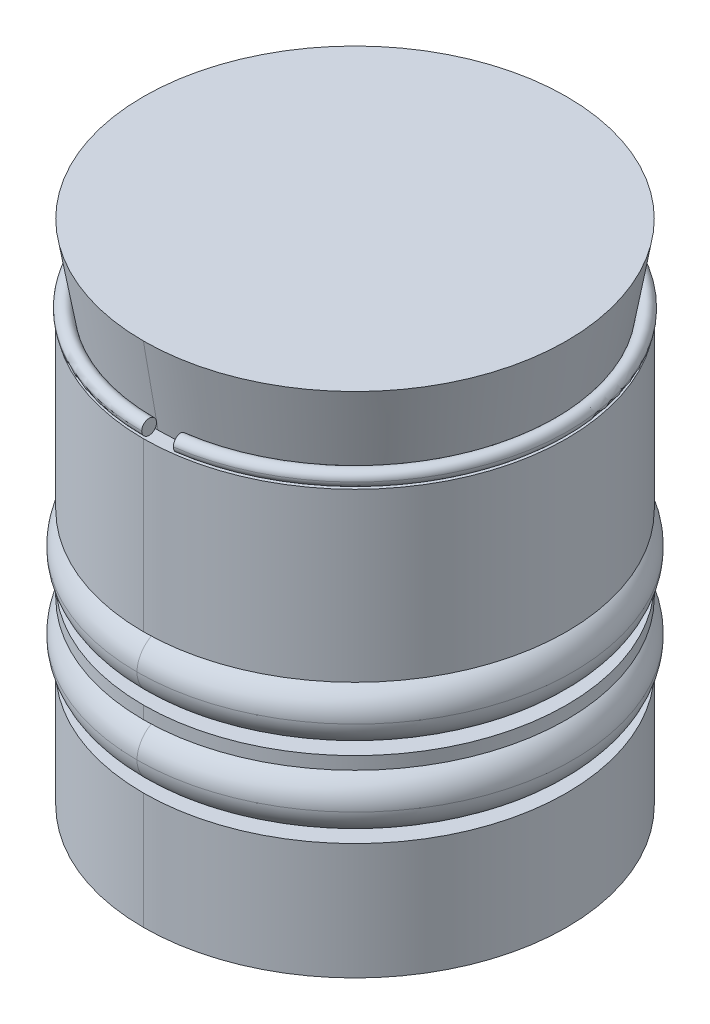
ISO-10303-21;
HEADER;
FILE_DESCRIPTION(('STEP AP214'),'2;1');
FILE_NAME('part.step','',(''),(''),'','','');
FILE_SCHEMA(('AUTOMOTIVE_DESIGN { 1 0 10303 214 1 1 1 1 }'));
ENDSEC;
DATA;
#1=APPLICATION_CONTEXT('core data for automotive mechanical design processes');
#2=APPLICATION_PROTOCOL_DEFINITION('international standard','automotive_design',2000,#1);
#3=PRODUCT_CONTEXT('',#1,'mechanical');
#4=PRODUCT('Part','Part','',(#3));
#5=PRODUCT_RELATED_PRODUCT_CATEGORY('part','',(#4));
#6=PRODUCT_DEFINITION_FORMATION('','',#4);
#7=PRODUCT_DEFINITION_CONTEXT('part definition',#1,'design');
#8=PRODUCT_DEFINITION('design','',#6,#7);
#9=PRODUCT_DEFINITION_SHAPE('','',#8);
#10=(LENGTH_UNIT() NAMED_UNIT(*) SI_UNIT(.MILLI.,.METRE.));
#11=(NAMED_UNIT(*) PLANE_ANGLE_UNIT() SI_UNIT($,.RADIAN.));
#12=(NAMED_UNIT(*) SI_UNIT($,.STERADIAN.) SOLID_ANGLE_UNIT());
#13=UNCERTAINTY_MEASURE_WITH_UNIT(LENGTH_MEASURE(1.E-05),#10,'distance_accuracy_value','');
#14=(GEOMETRIC_REPRESENTATION_CONTEXT(3) GLOBAL_UNCERTAINTY_ASSIGNED_CONTEXT((#13)) GLOBAL_UNIT_ASSIGNED_CONTEXT((#10,
#11,#12)) REPRESENTATION_CONTEXT('',''));
#15=CARTESIAN_POINT('',(0.,0.,0.));
#16=DIRECTION('',(0.,0.,1.));
#17=DIRECTION('',(1.,0.,0.));
#18=AXIS2_PLACEMENT_3D('',#15,#16,#17);
#19=CARTESIAN_POINT('',(0.,12.,0.));
#20=DIRECTION('',(0.,-1.,0.));
#21=DIRECTION('',(0.,0.,-1.));
#22=AXIS2_PLACEMENT_3D('',#19,#20,#21);
#23=PLANE('',#22);
#24=CARTESIAN_POINT('',(0.,12.,0.));
#25=DIRECTION('',(0.,1.,0.));
#26=DIRECTION('',(0.,0.,1.));
#27=AXIS2_PLACEMENT_3D('',#24,#25,#26);
#28=CIRCLE('',#27,5.);
#29=CARTESIAN_POINT('',(0.,12.,5.));
#30=VERTEX_POINT('',#29);
#31=CARTESIAN_POINT('',(0.,12.,-5.));
#32=VERTEX_POINT('',#31);
#33=EDGE_CURVE('P0_E194',#30,#32,#28,.T.);
#34=ORIENTED_EDGE('',*,*,#33,.T.);
#35=CARTESIAN_POINT('',(0.,12.,0.));
#36=DIRECTION('',(0.,1.,0.));
#37=DIRECTION('',(0.,0.,1.));
#38=AXIS2_PLACEMENT_3D('',#35,#36,#37);
#39=CIRCLE('',#38,5.);
#40=EDGE_CURVE('P0_E11',#32,#30,#39,.T.);
#41=ORIENTED_EDGE('',*,*,#40,.T.);
#42=EDGE_LOOP('',(#34,#41));
#43=FACE_BOUND('',#42,.T.);
#44=ADVANCED_FACE('P0_F16',(#43),#23,.F.);
#45=CARTESIAN_POINT('',(0.,10.,0.));
#46=DIRECTION('',(0.,1.,0.));
#47=DIRECTION('',(0.,0.,1.));
#48=AXIS2_PLACEMENT_3D('',#45,#46,#47);
#49=CONICAL_SURFACE('',#48,4.65371595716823,0.171442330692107);
#50=DIRECTION('',(0.,0.985339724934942,-0.17060371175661));
#51=VECTOR('',#50,1.);
#52=CARTESIAN_POINT('',(0.,10.,-4.65371595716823));
#53=LINE('',#52,#51);
#54=CARTESIAN_POINT('',(0.,10.,-4.65371595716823));
#55=VERTEX_POINT('',#54);
#56=EDGE_CURVE('P0_E190',#55,#32,#53,.T.);
#57=ORIENTED_EDGE('',*,*,#56,.F.);
#58=CARTESIAN_POINT('',(0.,10.,0.));
#59=DIRECTION('',(0.,1.,0.));
#60=DIRECTION('',(0.,0.,1.));
#61=AXIS2_PLACEMENT_3D('',#58,#59,#60);
#62=CIRCLE('',#61,4.65371595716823);
#63=CARTESIAN_POINT('',(0.,10.,4.65371595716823));
#64=VERTEX_POINT('',#63);
#65=EDGE_CURVE('P0_E27',#55,#64,#62,.T.);
#66=ORIENTED_EDGE('',*,*,#65,.T.);
#67=DIRECTION('',(0.,0.985339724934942,0.17060371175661));
#68=VECTOR('',#67,1.);
#69=CARTESIAN_POINT('',(0.,10.,4.65371595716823));
#70=LINE('',#69,#68);
#71=EDGE_CURVE('P0_E156',#64,#30,#70,.T.);
#72=ORIENTED_EDGE('',*,*,#71,.T.);
#73=ORIENTED_EDGE('',*,*,#40,.F.);
#74=EDGE_LOOP('',(#57,#66,#72,#73));
#75=FACE_BOUND('',#74,.T.);
#76=ADVANCED_FACE('P0_F352',(#75),#49,.T.);
#77=CARTESIAN_POINT('',(0.,10.,-5.));
#78=DIRECTION('',(0.,-1.,0.));
#79=DIRECTION('',(0.,0.,-1.));
#80=AXIS2_PLACEMENT_3D('',#77,#78,#79);
#81=PLANE('',#80);
#82=CARTESIAN_POINT('',(0.,10.,0.));
#83=DIRECTION('',(0.,1.,0.));
#84=DIRECTION('',(0.,0.,1.));
#85=AXIS2_PLACEMENT_3D('',#82,#83,#84);
#86=CIRCLE('',#85,4.65371595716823);
#87=EDGE_CURVE('P0_E188',#64,#55,#86,.T.);
#88=ORIENTED_EDGE('',*,*,#87,.F.);
#89=ORIENTED_EDGE('',*,*,#65,.F.);
#90=EDGE_LOOP('',(#88,#89));
#91=FACE_BOUND('',#90,.T.);
#92=CARTESIAN_POINT('',(0.,10.,0.));
#93=DIRECTION('',(0.,1.,0.));
#94=DIRECTION('',(0.,0.,1.));
#95=AXIS2_PLACEMENT_3D('',#92,#93,#94);
#96=CIRCLE('',#95,5.);
#97=CARTESIAN_POINT('',(0.,10.,5.));
#98=VERTEX_POINT('',#97);
#99=CARTESIAN_POINT('',(0.,10.,-5.));
#100=VERTEX_POINT('',#99);
#101=EDGE_CURVE('P0_E141',#98,#100,#96,.T.);
#102=ORIENTED_EDGE('',*,*,#101,.T.);
#103=CARTESIAN_POINT('',(0.,10.,0.));
#104=DIRECTION('',(0.,1.,0.));
#105=DIRECTION('',(0.,0.,1.));
#106=AXIS2_PLACEMENT_3D('',#103,#104,#105);
#107=CIRCLE('',#106,5.);
#108=EDGE_CURVE('P0_E129',#100,#98,#107,.T.);
#109=ORIENTED_EDGE('',*,*,#108,.T.);
#110=EDGE_LOOP('',(#102,#109));
#111=FACE_BOUND('',#110,.T.);
#112=ADVANCED_FACE('P0_F142',(#91,#111),#81,.F.);
#113=CARTESIAN_POINT('',(0.,12.,0.));
#114=DIRECTION('',(0.,1.,0.));
#115=DIRECTION('',(0.,0.,1.));
#116=AXIS2_PLACEMENT_3D('',#113,#114,#115);
#117=CYLINDRICAL_SURFACE('',#116,5.);
#118=DIRECTION('',(0.,1.,0.));
#119=VECTOR('',#118,1.);
#120=CARTESIAN_POINT('',(0.,12.,-5.));
#121=LINE('',#120,#119);
#122=CARTESIAN_POINT('',(0.,6.05,-5.));
#123=VERTEX_POINT('',#122);
#124=EDGE_CURVE('P0_E133',#123,#100,#121,.T.);
#125=ORIENTED_EDGE('',*,*,#124,.F.);
#126=CARTESIAN_POINT('',(0.,6.05,0.));
#127=DIRECTION('',(0.,1.,0.));
#128=DIRECTION('',(0.,0.,1.));
#129=AXIS2_PLACEMENT_3D('',#126,#127,#128);
#130=CIRCLE('',#129,5.);
#131=CARTESIAN_POINT('',(0.,6.05,5.));
#132=VERTEX_POINT('',#131);
#133=EDGE_CURVE('P0_E20',#123,#132,#130,.T.);
#134=ORIENTED_EDGE('',*,*,#133,.T.);
#135=DIRECTION('',(0.,1.,0.));
#136=VECTOR('',#135,1.);
#137=CARTESIAN_POINT('',(0.,12.,5.));
#138=LINE('',#137,#136);
#139=EDGE_CURVE('P0_E136',#132,#98,#138,.T.);
#140=ORIENTED_EDGE('',*,*,#139,.T.);
#141=ORIENTED_EDGE('',*,*,#108,.F.);
#142=EDGE_LOOP('',(#125,#134,#140,#141));
#143=FACE_BOUND('',#142,.T.);
#144=ADVANCED_FACE('P0_F131',(#143),#117,.T.);
#145=CARTESIAN_POINT('',(0.,6.05,-4.5));
#146=DIRECTION('',(0.,1.,0.));
#147=DIRECTION('',(0.,0.,-1.));
#148=AXIS2_PLACEMENT_3D('',#145,#146,#147);
#149=PLANE('',#148);
#150=CARTESIAN_POINT('',(0.,6.05,0.));
#151=DIRECTION('',(0.,1.,0.));
#152=DIRECTION('',(0.,0.,1.));
#153=AXIS2_PLACEMENT_3D('',#150,#151,#152);
#154=CIRCLE('',#153,4.5);
#155=CARTESIAN_POINT('',(0.,6.05,4.5));
#156=VERTEX_POINT('',#155);
#157=CARTESIAN_POINT('',(0.,6.05,-4.5));
#158=VERTEX_POINT('',#157);
#159=EDGE_CURVE('P0_E171',#156,#158,#154,.T.);
#160=ORIENTED_EDGE('',*,*,#159,.T.);
#161=CARTESIAN_POINT('',(0.,6.05,0.));
#162=DIRECTION('',(0.,1.,0.));
#163=DIRECTION('',(0.,0.,1.));
#164=AXIS2_PLACEMENT_3D('',#161,#162,#163);
#165=CIRCLE('',#164,4.5);
#166=EDGE_CURVE('P0_E184',#158,#156,#165,.T.);
#167=ORIENTED_EDGE('',*,*,#166,.T.);
#168=EDGE_LOOP('',(#160,#167));
#169=FACE_BOUND('',#168,.T.);
#170=CARTESIAN_POINT('',(0.,6.05,0.));
#171=DIRECTION('',(0.,1.,0.));
#172=DIRECTION('',(0.,0.,1.));
#173=AXIS2_PLACEMENT_3D('',#170,#171,#172);
#174=CIRCLE('',#173,5.);
#175=EDGE_CURVE('P0_E148',#132,#123,#174,.T.);
#176=ORIENTED_EDGE('',*,*,#175,.F.);
#177=ORIENTED_EDGE('',*,*,#133,.F.);
#178=EDGE_LOOP('',(#176,#177));
#179=FACE_BOUND('',#178,.T.);
#180=ADVANCED_FACE('P0_F311',(#169,#179),#149,.F.);
#181=CARTESIAN_POINT('',(0.,5.3,0.));
#182=DIRECTION('',(0.,1.,0.));
#183=DIRECTION('',(0.,0.,1.));
#184=AXIS2_PLACEMENT_3D('',#181,#182,#183);
#185=TOROIDAL_SURFACE('',#184,4.5,0.75);
#186=CARTESIAN_POINT('',(0.,5.3,0.));
#187=DIRECTION('',(0.,1.,0.));
#188=DIRECTION('',(0.,0.,1.));
#189=AXIS2_PLACEMENT_3D('',#186,#187,#188);
#190=CIRCLE('',#189,3.75);
#191=CARTESIAN_POINT('',(0.,5.3,3.75));
#192=VERTEX_POINT('',#191);
#193=CARTESIAN_POINT('',(0.,5.3,-3.75));
#194=VERTEX_POINT('',#193);
#195=EDGE_CURVE('P0_E172',#192,#194,#190,.T.);
#196=ORIENTED_EDGE('',*,*,#195,.F.);
#197=CARTESIAN_POINT('',(0.,5.3,4.5));
#198=DIRECTION('',(-1.,0.,0.));
#199=DIRECTION('',(0.,0.,1.));
#200=AXIS2_PLACEMENT_3D('',#197,#198,#199);
#201=CIRCLE('',#200,0.75);
#202=CARTESIAN_POINT('',(0.,4.55,4.5));
#203=VERTEX_POINT('',#202);
#204=EDGE_CURVE('P0_E261',#192,#203,#201,.T.);
#205=ORIENTED_EDGE('',*,*,#204,.T.);
#206=CARTESIAN_POINT('',(0.,4.55,0.));
#207=DIRECTION('',(0.,1.,0.));
#208=DIRECTION('',(0.,0.,1.));
#209=AXIS2_PLACEMENT_3D('',#206,#207,#208);
#210=CIRCLE('',#209,4.5);
#211=CARTESIAN_POINT('',(0.,4.55,-4.5));
#212=VERTEX_POINT('',#211);
#213=EDGE_CURVE('P0_E175',#203,#212,#210,.T.);
#214=ORIENTED_EDGE('',*,*,#213,.T.);
#215=CARTESIAN_POINT('',(0.,5.3,-4.5));
#216=DIRECTION('',(1.,0.,0.));
#217=DIRECTION('',(0.,0.,-1.));
#218=AXIS2_PLACEMENT_3D('',#215,#216,#217);
#219=CIRCLE('',#218,0.75);
#220=EDGE_CURVE('P0_E160',#194,#212,#219,.T.);
#221=ORIENTED_EDGE('',*,*,#220,.F.);
#222=EDGE_LOOP('',(#196,#205,#214,#221));
#223=FACE_BOUND('',#222,.T.);
#224=ADVANCED_FACE('P0_F579',(#223),#185,.F.);
#225=CARTESIAN_POINT('',(0.,4.55,-4.5));
#226=DIRECTION('',(0.,-1.,0.));
#227=DIRECTION('',(0.,0.,-1.));
#228=AXIS2_PLACEMENT_3D('',#225,#226,#227);
#229=PLANE('',#228);
#230=ORIENTED_EDGE('',*,*,#213,.F.);
#231=CARTESIAN_POINT('',(0.,4.55,0.));
#232=DIRECTION('',(0.,1.,0.));
#233=DIRECTION('',(0.,0.,1.));
#234=AXIS2_PLACEMENT_3D('',#231,#232,#233);
#235=CIRCLE('',#234,4.5);
#236=EDGE_CURVE('P0_E257',#212,#203,#235,.T.);
#237=ORIENTED_EDGE('',*,*,#236,.F.);
#238=EDGE_LOOP('',(#230,#237));
#239=FACE_BOUND('',#238,.T.);
#240=CARTESIAN_POINT('',(0.,4.55,0.));
#241=DIRECTION('',(0.,1.,0.));
#242=DIRECTION('',(0.,0.,1.));
#243=AXIS2_PLACEMENT_3D('',#240,#241,#242);
#244=CIRCLE('',#243,5.);
#245=CARTESIAN_POINT('',(0.,4.55,5.));
#246=VERTEX_POINT('',#245);
#247=CARTESIAN_POINT('',(0.,4.55,-5.));
#248=VERTEX_POINT('',#247);
#249=EDGE_CURVE('P0_E195',#246,#248,#244,.T.);
#250=ORIENTED_EDGE('',*,*,#249,.T.);
#251=CARTESIAN_POINT('',(0.,4.55,0.));
#252=DIRECTION('',(0.,1.,0.));
#253=DIRECTION('',(0.,0.,1.));
#254=AXIS2_PLACEMENT_3D('',#251,#252,#253);
#255=CIRCLE('',#254,5.);
#256=EDGE_CURVE('P0_E173',#248,#246,#255,.T.);
#257=ORIENTED_EDGE('',*,*,#256,.T.);
#258=EDGE_LOOP('',(#250,#257));
#259=FACE_BOUND('',#258,.T.);
#260=ADVANCED_FACE('P0_F391',(#239,#259),#229,.F.);
#261=CARTESIAN_POINT('',(0.,12.,0.));
#262=DIRECTION('',(0.,1.,0.));
#263=DIRECTION('',(0.,0.,1.));
#264=AXIS2_PLACEMENT_3D('',#261,#262,#263);
#265=CYLINDRICAL_SURFACE('',#264,5.);
#266=DIRECTION('',(0.,1.,0.));
#267=VECTOR('',#266,1.);
#268=CARTESIAN_POINT('',(0.,12.,-5.));
#269=LINE('',#268,#267);
#270=CARTESIAN_POINT('',(0.,4.25,-5.));
#271=VERTEX_POINT('',#270);
#272=EDGE_CURVE('P0_E200',#271,#248,#269,.T.);
#273=ORIENTED_EDGE('',*,*,#272,.F.);
#274=CARTESIAN_POINT('',(0.,4.25,0.));
#275=DIRECTION('',(0.,1.,0.));
#276=DIRECTION('',(0.,0.,1.));
#277=AXIS2_PLACEMENT_3D('',#274,#275,#276);
#278=CIRCLE('',#277,5.);
#279=CARTESIAN_POINT('',(0.,4.25,5.));
#280=VERTEX_POINT('',#279);
#281=EDGE_CURVE('P0_E176',#271,#280,#278,.T.);
#282=ORIENTED_EDGE('',*,*,#281,.T.);
#283=DIRECTION('',(0.,1.,0.));
#284=VECTOR('',#283,1.);
#285=CARTESIAN_POINT('',(0.,12.,5.));
#286=LINE('',#285,#284);
#287=EDGE_CURVE('P0_E199',#280,#246,#286,.T.);
#288=ORIENTED_EDGE('',*,*,#287,.T.);
#289=ORIENTED_EDGE('',*,*,#256,.F.);
#290=EDGE_LOOP('',(#273,#282,#288,#289));
#291=FACE_BOUND('',#290,.T.);
#292=ADVANCED_FACE('P0_F560',(#291),#265,.T.);
#293=CARTESIAN_POINT('',(0.,4.25,-4.5));
#294=DIRECTION('',(0.,1.,0.));
#295=DIRECTION('',(0.,0.,-1.));
#296=AXIS2_PLACEMENT_3D('',#293,#294,#295);
#297=PLANE('',#296);
#298=CARTESIAN_POINT('',(0.,4.25,0.));
#299=DIRECTION('',(0.,1.,0.));
#300=DIRECTION('',(0.,0.,1.));
#301=AXIS2_PLACEMENT_3D('',#298,#299,#300);
#302=CIRCLE('',#301,4.5);
#303=CARTESIAN_POINT('',(0.,4.25,4.5));
#304=VERTEX_POINT('',#303);
#305=CARTESIAN_POINT('',(0.,4.25,-4.5));
#306=VERTEX_POINT('',#305);
#307=EDGE_CURVE('P0_E182',#304,#306,#302,.T.);
#308=ORIENTED_EDGE('',*,*,#307,.T.);
#309=CARTESIAN_POINT('',(0.,4.25,0.));
#310=DIRECTION('',(0.,1.,0.));
#311=DIRECTION('',(0.,0.,1.));
#312=AXIS2_PLACEMENT_3D('',#309,#310,#311);
#313=CIRCLE('',#312,4.5);
#314=EDGE_CURVE('P0_E181',#306,#304,#313,.T.);
#315=ORIENTED_EDGE('',*,*,#314,.T.);
#316=EDGE_LOOP('',(#308,#315));
#317=FACE_BOUND('',#316,.T.);
#318=CARTESIAN_POINT('',(0.,4.25,0.));
#319=DIRECTION('',(0.,1.,0.));
#320=DIRECTION('',(0.,0.,1.));
#321=AXIS2_PLACEMENT_3D('',#318,#319,#320);
#322=CIRCLE('',#321,5.);
#323=EDGE_CURVE('P0_E231',#280,#271,#322,.T.);
#324=ORIENTED_EDGE('',*,*,#323,.F.);
#325=ORIENTED_EDGE('',*,*,#281,.F.);
#326=EDGE_LOOP('',(#324,#325));
#327=FACE_BOUND('',#326,.T.);
#328=ADVANCED_FACE('P0_F278',(#317,#327),#297,.F.);
#329=CARTESIAN_POINT('',(0.,3.5,0.));
#330=DIRECTION('',(0.,1.,0.));
#331=DIRECTION('',(0.,0.,1.));
#332=AXIS2_PLACEMENT_3D('',#329,#330,#331);
#333=TOROIDAL_SURFACE('',#332,4.5,0.75);
#334=CARTESIAN_POINT('',(0.,3.5,0.));
#335=DIRECTION('',(0.,1.,0.));
#336=DIRECTION('',(0.,0.,1.));
#337=AXIS2_PLACEMENT_3D('',#334,#335,#336);
#338=CIRCLE('',#337,3.75);
#339=CARTESIAN_POINT('',(0.,3.5,3.75));
#340=VERTEX_POINT('',#339);
#341=CARTESIAN_POINT('',(0.,3.5,-3.75));
#342=VERTEX_POINT('',#341);
#343=EDGE_CURVE('P0_E244',#340,#342,#338,.T.);
#344=ORIENTED_EDGE('',*,*,#343,.F.);
#345=CARTESIAN_POINT('',(0.,3.5,4.5));
#346=DIRECTION('',(-1.,0.,0.));
#347=DIRECTION('',(0.,0.,1.));
#348=AXIS2_PLACEMENT_3D('',#345,#346,#347);
#349=CIRCLE('',#348,0.75);
#350=CARTESIAN_POINT('',(0.,2.75,4.5));
#351=VERTEX_POINT('',#350);
#352=EDGE_CURVE('P0_E162',#340,#351,#349,.T.);
#353=ORIENTED_EDGE('',*,*,#352,.T.);
#354=CARTESIAN_POINT('',(0.,2.75,0.));
#355=DIRECTION('',(0.,1.,0.));
#356=DIRECTION('',(0.,0.,1.));
#357=AXIS2_PLACEMENT_3D('',#354,#355,#356);
#358=CIRCLE('',#357,4.5);
#359=CARTESIAN_POINT('',(0.,2.75,-4.5));
#360=VERTEX_POINT('',#359);
#361=EDGE_CURVE('P0_E213',#351,#360,#358,.T.);
#362=ORIENTED_EDGE('',*,*,#361,.T.);
#363=CARTESIAN_POINT('',(0.,3.5,-4.5));
#364=DIRECTION('',(1.,0.,0.));
#365=DIRECTION('',(0.,0.,-1.));
#366=AXIS2_PLACEMENT_3D('',#363,#364,#365);
#367=CIRCLE('',#366,0.75);
#368=EDGE_CURVE('P0_E220',#342,#360,#367,.T.);
#369=ORIENTED_EDGE('',*,*,#368,.F.);
#370=EDGE_LOOP('',(#344,#353,#362,#369));
#371=FACE_BOUND('',#370,.T.);
#372=ADVANCED_FACE('P0_F370',(#371),#333,.F.);
#373=CARTESIAN_POINT('',(0.,2.75,-4.5));
#374=DIRECTION('',(0.,-1.,0.));
#375=DIRECTION('',(0.,0.,-1.));
#376=AXIS2_PLACEMENT_3D('',#373,#374,#375);
#377=PLANE('',#376);
#378=ORIENTED_EDGE('',*,*,#361,.F.);
#379=CARTESIAN_POINT('',(0.,2.75,0.));
#380=DIRECTION('',(0.,1.,0.));
#381=DIRECTION('',(0.,0.,1.));
#382=AXIS2_PLACEMENT_3D('',#379,#380,#381);
#383=CIRCLE('',#382,4.5);
#384=EDGE_CURVE('P0_E166',#360,#351,#383,.T.);
#385=ORIENTED_EDGE('',*,*,#384,.F.);
#386=EDGE_LOOP('',(#378,#385));
#387=FACE_BOUND('',#386,.T.);
#388=CARTESIAN_POINT('',(0.,2.75,0.));
#389=DIRECTION('',(0.,1.,0.));
#390=DIRECTION('',(0.,0.,1.));
#391=AXIS2_PLACEMENT_3D('',#388,#389,#390);
#392=CIRCLE('',#391,5.);
#393=CARTESIAN_POINT('',(0.,2.75,5.));
#394=VERTEX_POINT('',#393);
#395=CARTESIAN_POINT('',(0.,2.75,-5.));
#396=VERTEX_POINT('',#395);
#397=EDGE_CURVE('P0_E212',#394,#396,#392,.T.);
#398=ORIENTED_EDGE('',*,*,#397,.T.);
#399=CARTESIAN_POINT('',(0.,2.75,0.));
#400=DIRECTION('',(0.,1.,0.));
#401=DIRECTION('',(0.,0.,1.));
#402=AXIS2_PLACEMENT_3D('',#399,#400,#401);
#403=CIRCLE('',#402,5.);
#404=EDGE_CURVE('P0_E41',#396,#394,#403,.T.);
#405=ORIENTED_EDGE('',*,*,#404,.T.);
#406=EDGE_LOOP('',(#398,#405));
#407=FACE_BOUND('',#406,.T.);
#408=ADVANCED_FACE('P0_F372',(#387,#407),#377,.F.);
#409=CARTESIAN_POINT('',(0.,12.,0.));
#410=DIRECTION('',(0.,1.,0.));
#411=DIRECTION('',(0.,0.,1.));
#412=AXIS2_PLACEMENT_3D('',#409,#410,#411);
#413=CYLINDRICAL_SURFACE('',#412,5.);
#414=DIRECTION('',(0.,1.,0.));
#415=VECTOR('',#414,1.);
#416=CARTESIAN_POINT('',(0.,12.,-5.));
#417=LINE('',#416,#415);
#418=CARTESIAN_POINT('',(0.,0.,-5.));
#419=VERTEX_POINT('',#418);
#420=EDGE_CURVE('P0_E204',#419,#396,#417,.T.);
#421=ORIENTED_EDGE('',*,*,#420,.F.);
#422=CARTESIAN_POINT('',(0.,0.,0.));
#423=DIRECTION('',(0.,1.,0.));
#424=DIRECTION('',(0.,0.,1.));
#425=AXIS2_PLACEMENT_3D('',#422,#423,#424);
#426=CIRCLE('',#425,5.);
#427=CARTESIAN_POINT('',(0.,0.,5.));
#428=VERTEX_POINT('',#427);
#429=EDGE_CURVE('P0_E205',#419,#428,#426,.T.);
#430=ORIENTED_EDGE('',*,*,#429,.T.);
#431=DIRECTION('',(0.,1.,0.));
#432=VECTOR('',#431,1.);
#433=CARTESIAN_POINT('',(0.,12.,5.));
#434=LINE('',#433,#432);
#435=EDGE_CURVE('P0_E208',#428,#394,#434,.T.);
#436=ORIENTED_EDGE('',*,*,#435,.T.);
#437=ORIENTED_EDGE('',*,*,#404,.F.);
#438=EDGE_LOOP('',(#421,#430,#436,#437));
#439=FACE_BOUND('',#438,.T.);
#440=ADVANCED_FACE('P0_F18',(#439),#413,.T.);
#441=CARTESIAN_POINT('',(0.,0.,-5.));
#442=DIRECTION('',(0.,1.,0.));
#443=DIRECTION('',(0.,0.,-1.));
#444=AXIS2_PLACEMENT_3D('',#441,#442,#443);
#445=PLANE('',#444);
#446=CARTESIAN_POINT('',(0.,0.,0.));
#447=DIRECTION('',(0.,1.,0.));
#448=DIRECTION('',(0.,0.,1.));
#449=AXIS2_PLACEMENT_3D('',#446,#447,#448);
#450=CIRCLE('',#449,5.);
#451=EDGE_CURVE('P0_E165',#428,#419,#450,.T.);
#452=ORIENTED_EDGE('',*,*,#451,.F.);
#453=ORIENTED_EDGE('',*,*,#429,.F.);
#454=EDGE_LOOP('',(#452,#453));
#455=FACE_BOUND('',#454,.T.);
#456=ADVANCED_FACE('P0_F395',(#455),#445,.F.);
#457=CARTESIAN_POINT('',(0.,12.,0.));
#458=DIRECTION('',(0.,1.,0.));
#459=DIRECTION('',(0.,0.,1.));
#460=AXIS2_PLACEMENT_3D('',#457,#458,#459);
#461=CYLINDRICAL_SURFACE('',#460,5.);
#462=ORIENTED_EDGE('',*,*,#451,.T.);
#463=ORIENTED_EDGE('',*,*,#420,.T.);
#464=ORIENTED_EDGE('',*,*,#397,.F.);
#465=ORIENTED_EDGE('',*,*,#435,.F.);
#466=EDGE_LOOP('',(#462,#463,#464,#465));
#467=FACE_BOUND('',#466,.T.);
#468=ADVANCED_FACE('P0_F398',(#467),#461,.T.);
#469=CARTESIAN_POINT('',(0.,3.5,0.));
#470=DIRECTION('',(0.,1.,0.));
#471=DIRECTION('',(0.,0.,1.));
#472=AXIS2_PLACEMENT_3D('',#469,#470,#471);
#473=TOROIDAL_SURFACE('',#472,4.5,0.75);
#474=CARTESIAN_POINT('',(0.,3.5,0.));
#475=DIRECTION('',(0.,1.,0.));
#476=DIRECTION('',(0.,0.,1.));
#477=AXIS2_PLACEMENT_3D('',#474,#475,#476);
#478=CIRCLE('',#477,3.75);
#479=EDGE_CURVE('P0_E178',#342,#340,#478,.T.);
#480=ORIENTED_EDGE('',*,*,#479,.F.);
#481=ORIENTED_EDGE('',*,*,#368,.T.);
#482=ORIENTED_EDGE('',*,*,#384,.T.);
#483=ORIENTED_EDGE('',*,*,#352,.F.);
#484=EDGE_LOOP('',(#480,#481,#482,#483));
#485=FACE_BOUND('',#484,.T.);
#486=ADVANCED_FACE('P0_F386',(#485),#473,.F.);
#487=CARTESIAN_POINT('',(0.,12.,0.));
#488=DIRECTION('',(0.,1.,0.));
#489=DIRECTION('',(0.,0.,1.));
#490=AXIS2_PLACEMENT_3D('',#487,#488,#489);
#491=CYLINDRICAL_SURFACE('',#490,5.);
#492=ORIENTED_EDGE('',*,*,#323,.T.);
#493=ORIENTED_EDGE('',*,*,#272,.T.);
#494=ORIENTED_EDGE('',*,*,#249,.F.);
#495=ORIENTED_EDGE('',*,*,#287,.F.);
#496=EDGE_LOOP('',(#492,#493,#494,#495));
#497=FACE_BOUND('',#496,.T.);
#498=ADVANCED_FACE('P0_F380',(#497),#491,.T.);
#499=CARTESIAN_POINT('',(0.,5.3,0.));
#500=DIRECTION('',(0.,1.,0.));
#501=DIRECTION('',(0.,0.,1.));
#502=AXIS2_PLACEMENT_3D('',#499,#500,#501);
#503=TOROIDAL_SURFACE('',#502,4.5,0.75);
#504=CARTESIAN_POINT('',(0.,5.3,0.));
#505=DIRECTION('',(0.,1.,0.));
#506=DIRECTION('',(0.,0.,1.));
#507=AXIS2_PLACEMENT_3D('',#504,#505,#506);
#508=CIRCLE('',#507,3.75);
#509=EDGE_CURVE('P0_E189',#194,#192,#508,.T.);
#510=ORIENTED_EDGE('',*,*,#509,.F.);
#511=ORIENTED_EDGE('',*,*,#220,.T.);
#512=ORIENTED_EDGE('',*,*,#236,.T.);
#513=ORIENTED_EDGE('',*,*,#204,.F.);
#514=EDGE_LOOP('',(#510,#511,#512,#513));
#515=FACE_BOUND('',#514,.T.);
#516=ADVANCED_FACE('P0_F374',(#515),#503,.F.);
#517=CARTESIAN_POINT('',(0.,12.,0.));
#518=DIRECTION('',(0.,1.,0.));
#519=DIRECTION('',(0.,0.,1.));
#520=AXIS2_PLACEMENT_3D('',#517,#518,#519);
#521=CYLINDRICAL_SURFACE('',#520,5.);
#522=ORIENTED_EDGE('',*,*,#175,.T.);
#523=ORIENTED_EDGE('',*,*,#124,.T.);
#524=ORIENTED_EDGE('',*,*,#101,.F.);
#525=ORIENTED_EDGE('',*,*,#139,.F.);
#526=EDGE_LOOP('',(#522,#523,#524,#525));
#527=FACE_BOUND('',#526,.T.);
#528=ADVANCED_FACE('P0_F146',(#527),#521,.T.);
#529=CARTESIAN_POINT('',(0.,10.,0.));
#530=DIRECTION('',(0.,1.,0.));
#531=DIRECTION('',(0.,0.,1.));
#532=AXIS2_PLACEMENT_3D('',#529,#530,#531);
#533=CONICAL_SURFACE('',#532,4.65371595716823,0.171442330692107);
#534=ORIENTED_EDGE('',*,*,#87,.T.);
#535=ORIENTED_EDGE('',*,*,#56,.T.);
#536=ORIENTED_EDGE('',*,*,#33,.F.);
#537=ORIENTED_EDGE('',*,*,#71,.F.);
#538=EDGE_LOOP('',(#534,#535,#536,#537));
#539=FACE_BOUND('',#538,.T.);
#540=ADVANCED_FACE('P0_F349',(#539),#533,.T.);
#541=CARTESIAN_POINT('',(0.,5.3,0.));
#542=DIRECTION('',(0.,1.,0.));
#543=DIRECTION('',(0.,0.,1.));
#544=AXIS2_PLACEMENT_3D('',#541,#542,#543);
#545=TOROIDAL_SURFACE('',#544,4.5,0.75);
#546=CARTESIAN_POINT('',(0.,5.3,-4.5));
#547=DIRECTION('',(1.,0.,0.));
#548=DIRECTION('',(0.,0.,-1.));
#549=AXIS2_PLACEMENT_3D('',#546,#547,#548);
#550=CIRCLE('',#549,0.75);
#551=EDGE_CURVE('P0_E167',#158,#194,#550,.T.);
#552=ORIENTED_EDGE('',*,*,#551,.T.);
#553=ORIENTED_EDGE('',*,*,#509,.T.);
#554=CARTESIAN_POINT('',(0.,5.3,4.5));
#555=DIRECTION('',(-1.,0.,0.));
#556=DIRECTION('',(0.,0.,1.));
#557=AXIS2_PLACEMENT_3D('',#554,#555,#556);
#558=CIRCLE('',#557,0.75);
#559=EDGE_CURVE('P0_E320',#156,#192,#558,.T.);
#560=ORIENTED_EDGE('',*,*,#559,.F.);
#561=ORIENTED_EDGE('',*,*,#166,.F.);
#562=EDGE_LOOP('',(#552,#553,#560,#561));
#563=FACE_BOUND('',#562,.T.);
#564=ADVANCED_FACE('P0_F323',(#563),#545,.F.);
#565=CARTESIAN_POINT('',(0.,3.5,0.));
#566=DIRECTION('',(0.,1.,0.));
#567=DIRECTION('',(0.,0.,1.));
#568=AXIS2_PLACEMENT_3D('',#565,#566,#567);
#569=TOROIDAL_SURFACE('',#568,4.5,0.75);
#570=CARTESIAN_POINT('',(0.,3.5,-4.5));
#571=DIRECTION('',(1.,0.,0.));
#572=DIRECTION('',(0.,0.,-1.));
#573=AXIS2_PLACEMENT_3D('',#570,#571,#572);
#574=CIRCLE('',#573,0.75);
#575=EDGE_CURVE('P0_E240',#306,#342,#574,.T.);
#576=ORIENTED_EDGE('',*,*,#575,.T.);
#577=ORIENTED_EDGE('',*,*,#479,.T.);
#578=CARTESIAN_POINT('',(0.,3.5,4.5));
#579=DIRECTION('',(-1.,0.,0.));
#580=DIRECTION('',(0.,0.,1.));
#581=AXIS2_PLACEMENT_3D('',#578,#579,#580);
#582=CIRCLE('',#581,0.75);
#583=EDGE_CURVE('P0_E256',#304,#340,#582,.T.);
#584=ORIENTED_EDGE('',*,*,#583,.F.);
#585=ORIENTED_EDGE('',*,*,#314,.F.);
#586=EDGE_LOOP('',(#576,#577,#584,#585));
#587=FACE_BOUND('',#586,.T.);
#588=ADVANCED_FACE('P0_F285',(#587),#569,.F.);
#589=CARTESIAN_POINT('',(0.,3.5,0.));
#590=DIRECTION('',(0.,1.,0.));
#591=DIRECTION('',(0.,0.,1.));
#592=AXIS2_PLACEMENT_3D('',#589,#590,#591);
#593=TOROIDAL_SURFACE('',#592,4.5,0.75);
#594=ORIENTED_EDGE('',*,*,#583,.T.);
#595=ORIENTED_EDGE('',*,*,#343,.T.);
#596=ORIENTED_EDGE('',*,*,#575,.F.);
#597=ORIENTED_EDGE('',*,*,#307,.F.);
#598=EDGE_LOOP('',(#594,#595,#596,#597));
#599=FACE_BOUND('',#598,.T.);
#600=ADVANCED_FACE('P0_F282',(#599),#593,.F.);
#601=CARTESIAN_POINT('',(0.,5.3,0.));
#602=DIRECTION('',(0.,1.,0.));
#603=DIRECTION('',(0.,0.,1.));
#604=AXIS2_PLACEMENT_3D('',#601,#602,#603);
#605=TOROIDAL_SURFACE('',#604,4.5,0.75);
#606=ORIENTED_EDGE('',*,*,#559,.T.);
#607=ORIENTED_EDGE('',*,*,#195,.T.);
#608=ORIENTED_EDGE('',*,*,#551,.F.);
#609=ORIENTED_EDGE('',*,*,#159,.F.);
#610=EDGE_LOOP('',(#606,#607,#608,#609));
#611=FACE_BOUND('',#610,.T.);
#612=ADVANCED_FACE('P0_F318',(#611),#605,.F.);
#613=CLOSED_SHELL('',(#44,#76,#112,#144,#180,#224,#260,#292,#328,#372,#408,#440,#456,#468,#486,
#498,#516,#528,#540,#564,#588,#600,#612));
#614=MANIFOLD_SOLID_BREP('P0_B1',#613);
#615=CARTESIAN_POINT('',(0.673985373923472,10.175,4.81726186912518));
#616=DIRECTION('',(0.990353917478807,0.,-0.138560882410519));
#617=DIRECTION('',(0.,-1.,0.));
#618=AXIS2_PLACEMENT_3D('',#615,#616,#617);
#619=PLANE('',#618);
#620=CARTESIAN_POINT('',(0.673985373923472,10.175,4.81726186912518));
#621=DIRECTION('',(0.990353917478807,0.,-0.138560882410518));
#622=DIRECTION('',(-0.138560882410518,0.,-0.990353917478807));
#623=AXIS2_PLACEMENT_3D('',#620,#621,#622);
#624=CIRCLE('',#623,0.175);
#625=CARTESIAN_POINT('',(0.649737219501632,10.175,4.64394993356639));
#626=VERTEX_POINT('',#625);
#627=CARTESIAN_POINT('',(0.698233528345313,10.175,4.99057380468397));
#628=VERTEX_POINT('',#627);
#629=EDGE_CURVE('P1_E20',#626,#628,#624,.T.);
#630=ORIENTED_EDGE('',*,*,#629,.F.);
#631=CARTESIAN_POINT('',(0.673985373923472,10.175,4.81726186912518));
#632=DIRECTION('',(0.990353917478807,0.,-0.138560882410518));
#633=DIRECTION('',(-0.138560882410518,0.,-0.990353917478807));
#634=AXIS2_PLACEMENT_3D('',#631,#632,#633);
#635=CIRCLE('',#634,0.175);
#636=EDGE_CURVE('P1_E26',#628,#626,#635,.T.);
#637=ORIENTED_EDGE('',*,*,#636,.F.);
#638=EDGE_LOOP('',(#630,#637));
#639=FACE_BOUND('',#638,.T.);
#640=ADVANCED_FACE('P1_F16',(#639),#619,.F.);
#641=CARTESIAN_POINT('',(0.,10.175,4.86418217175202));
#642=DIRECTION('',(1.,0.,0.));
#643=DIRECTION('',(0.,1.,0.));
#644=AXIS2_PLACEMENT_3D('',#641,#642,#643);
#645=PLANE('',#644);
#646=CARTESIAN_POINT('',(0.,10.175,4.86418217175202));
#647=DIRECTION('',(1.,0.,0.));
#648=DIRECTION('',(0.,0.,-1.));
#649=AXIS2_PLACEMENT_3D('',#646,#647,#648);
#650=CIRCLE('',#649,0.175);
#651=CARTESIAN_POINT('',(0.,10.175,4.68918217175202));
#652=VERTEX_POINT('',#651);
#653=CARTESIAN_POINT('',(0.,10.175,5.03918217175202));
#654=VERTEX_POINT('',#653);
#655=EDGE_CURVE('P1_E66',#652,#654,#650,.T.);
#656=ORIENTED_EDGE('',*,*,#655,.T.);
#657=CARTESIAN_POINT('',(0.,10.175,4.86418217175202));
#658=DIRECTION('',(1.,0.,0.));
#659=DIRECTION('',(0.,0.,-1.));
#660=AXIS2_PLACEMENT_3D('',#657,#658,#659);
#661=CIRCLE('',#660,0.175);
#662=EDGE_CURVE('P1_E11',#654,#652,#661,.T.);
#663=ORIENTED_EDGE('',*,*,#662,.T.);
#664=EDGE_LOOP('',(#656,#663));
#665=FACE_BOUND('',#664,.T.);
#666=ADVANCED_FACE('P1_F18',(#665),#645,.T.);
#667=CARTESIAN_POINT('',(0.,10.175,0.));
#668=DIRECTION('',(0.,1.,0.));
#669=DIRECTION('',(0.,0.,1.));
#670=AXIS2_PLACEMENT_3D('',#667,#668,#669);
#671=TOROIDAL_SURFACE('',#670,4.86418217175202,0.175);
#672=CARTESIAN_POINT('',(0.,10.175,0.));
#673=DIRECTION('',(0.,1.,0.));
#674=DIRECTION('',(0.,0.,1.));
#675=AXIS2_PLACEMENT_3D('',#672,#673,#674);
#676=CIRCLE('',#675,5.03918217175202);
#677=EDGE_CURVE('P1_E58',#628,#654,#676,.T.);
#678=ORIENTED_EDGE('',*,*,#677,.F.);
#679=ORIENTED_EDGE('',*,*,#636,.T.);
#680=CARTESIAN_POINT('',(0.,10.175,0.));
#681=DIRECTION('',(0.,1.,0.));
#682=DIRECTION('',(0.,0.,1.));
#683=AXIS2_PLACEMENT_3D('',#680,#681,#682);
#684=CIRCLE('',#683,4.68918217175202);
#685=EDGE_CURVE('P1_E55',#626,#652,#684,.T.);
#686=ORIENTED_EDGE('',*,*,#685,.T.);
#687=ORIENTED_EDGE('',*,*,#662,.F.);
#688=EDGE_LOOP('',(#678,#679,#686,#687));
#689=FACE_BOUND('',#688,.T.);
#690=ADVANCED_FACE('P1_F54',(#689),#671,.T.);
#691=CARTESIAN_POINT('',(0.,10.175,0.));
#692=DIRECTION('',(0.,1.,0.));
#693=DIRECTION('',(0.,0.,1.));
#694=AXIS2_PLACEMENT_3D('',#691,#692,#693);
#695=TOROIDAL_SURFACE('',#694,4.86418217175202,0.175);
#696=ORIENTED_EDGE('',*,*,#629,.T.);
#697=ORIENTED_EDGE('',*,*,#677,.T.);
#698=ORIENTED_EDGE('',*,*,#655,.F.);
#699=ORIENTED_EDGE('',*,*,#685,.F.);
#700=EDGE_LOOP('',(#696,#697,#698,#699));
#701=FACE_BOUND('',#700,.T.);
#702=ADVANCED_FACE('P1_F65',(#701),#695,.T.);
#703=CLOSED_SHELL('',(#640,#666,#690,#702));
#704=MANIFOLD_SOLID_BREP('P1_B1',#703);
#705=CARTESIAN_POINT('',(0.,3.5,0.));
#706=DIRECTION('',(0.,1.,0.));
#707=DIRECTION('',(0.,0.,1.));
#708=AXIS2_PLACEMENT_3D('',#705,#706,#707);
#709=TOROIDAL_SURFACE('',#708,4.5,0.65);
#710=CARTESIAN_POINT('',(0.,3.5,0.));
#711=DIRECTION('',(0.,1.,0.));
#712=DIRECTION('',(0.,0.,1.));
#713=AXIS2_PLACEMENT_3D('',#710,#711,#712);
#714=CIRCLE('',#713,5.15);
#715=CARTESIAN_POINT('',(0.,3.5,-5.15));
#716=VERTEX_POINT('',#715);
#717=CARTESIAN_POINT('',(0.,3.5,5.15));
#718=VERTEX_POINT('',#717);
#719=EDGE_CURVE('P2_E60',#716,#718,#714,.T.);
#720=ORIENTED_EDGE('',*,*,#719,.F.);
#721=CARTESIAN_POINT('',(0.,3.5,-4.5));
#722=DIRECTION('',(1.,0.,0.));
#723=DIRECTION('',(0.,0.,-1.));
#724=AXIS2_PLACEMENT_3D('',#721,#722,#723);
#725=CIRCLE('',#724,0.65);
#726=CARTESIAN_POINT('',(0.,3.5,-3.85));
#727=VERTEX_POINT('',#726);
#728=EDGE_CURVE('P2_E11',#727,#716,#725,.T.);
#729=ORIENTED_EDGE('',*,*,#728,.F.);
#730=CARTESIAN_POINT('',(0.,3.5,0.));
#731=DIRECTION('',(0.,1.,0.));
#732=DIRECTION('',(0.,0.,1.));
#733=AXIS2_PLACEMENT_3D('',#730,#731,#732);
#734=CIRCLE('',#733,3.85);
#735=CARTESIAN_POINT('',(0.,3.5,3.85));
#736=VERTEX_POINT('',#735);
#737=EDGE_CURVE('P2_E57',#727,#736,#734,.T.);
#738=ORIENTED_EDGE('',*,*,#737,.T.);
#739=CARTESIAN_POINT('',(0.,3.5,4.5));
#740=DIRECTION('',(-1.,0.,0.));
#741=DIRECTION('',(0.,0.,1.));
#742=AXIS2_PLACEMENT_3D('',#739,#740,#741);
#743=CIRCLE('',#742,0.65);
#744=EDGE_CURVE('P2_E26',#736,#718,#743,.T.);
#745=ORIENTED_EDGE('',*,*,#744,.T.);
#746=EDGE_LOOP('',(#720,#729,#738,#745));
#747=FACE_BOUND('',#746,.T.);
#748=ADVANCED_FACE('P2_F16',(#747),#709,.T.);
#749=CARTESIAN_POINT('',(0.,3.5,0.));
#750=DIRECTION('',(0.,1.,0.));
#751=DIRECTION('',(0.,0.,1.));
#752=AXIS2_PLACEMENT_3D('',#749,#750,#751);
#753=TOROIDAL_SURFACE('',#752,4.5,0.65);
#754=CARTESIAN_POINT('',(0.,3.5,0.));
#755=DIRECTION('',(0.,1.,0.));
#756=DIRECTION('',(0.,0.,1.));
#757=AXIS2_PLACEMENT_3D('',#754,#755,#756);
#758=CIRCLE('',#757,5.15);
#759=EDGE_CURVE('P2_E68',#718,#716,#758,.T.);
#760=ORIENTED_EDGE('',*,*,#759,.F.);
#761=ORIENTED_EDGE('',*,*,#744,.F.);
#762=CARTESIAN_POINT('',(0.,3.5,0.));
#763=DIRECTION('',(0.,1.,0.));
#764=DIRECTION('',(0.,0.,1.));
#765=AXIS2_PLACEMENT_3D('',#762,#763,#764);
#766=CIRCLE('',#765,3.85);
#767=EDGE_CURVE('P2_E62',#736,#727,#766,.T.);
#768=ORIENTED_EDGE('',*,*,#767,.T.);
#769=ORIENTED_EDGE('',*,*,#728,.T.);
#770=EDGE_LOOP('',(#760,#761,#768,#769));
#771=FACE_BOUND('',#770,.T.);
#772=ADVANCED_FACE('P2_F63',(#771),#753,.T.);
#773=CARTESIAN_POINT('',(0.,3.5,0.));
#774=DIRECTION('',(0.,1.,0.));
#775=DIRECTION('',(0.,0.,1.));
#776=AXIS2_PLACEMENT_3D('',#773,#774,#775);
#777=TOROIDAL_SURFACE('',#776,4.5,0.65);
#778=CARTESIAN_POINT('',(0.,3.5,4.5));
#779=DIRECTION('',(-1.,0.,0.));
#780=DIRECTION('',(0.,0.,1.));
#781=AXIS2_PLACEMENT_3D('',#778,#779,#780);
#782=CIRCLE('',#781,0.65);
#783=EDGE_CURVE('P2_E19',#718,#736,#782,.T.);
#784=ORIENTED_EDGE('',*,*,#783,.F.);
#785=ORIENTED_EDGE('',*,*,#759,.T.);
#786=CARTESIAN_POINT('',(0.,3.5,-4.5));
#787=DIRECTION('',(1.,0.,0.));
#788=DIRECTION('',(0.,0.,-1.));
#789=AXIS2_PLACEMENT_3D('',#786,#787,#788);
#790=CIRCLE('',#789,0.65);
#791=EDGE_CURVE('P2_E72',#716,#727,#790,.T.);
#792=ORIENTED_EDGE('',*,*,#791,.T.);
#793=ORIENTED_EDGE('',*,*,#767,.F.);
#794=EDGE_LOOP('',(#784,#785,#792,#793));
#795=FACE_BOUND('',#794,.T.);
#796=ADVANCED_FACE('P2_F75',(#795),#777,.T.);
#797=CARTESIAN_POINT('',(0.,3.5,0.));
#798=DIRECTION('',(0.,1.,0.));
#799=DIRECTION('',(0.,0.,1.));
#800=AXIS2_PLACEMENT_3D('',#797,#798,#799);
#801=TOROIDAL_SURFACE('',#800,4.5,0.65);
#802=ORIENTED_EDGE('',*,*,#791,.F.);
#803=ORIENTED_EDGE('',*,*,#719,.T.);
#804=ORIENTED_EDGE('',*,*,#783,.T.);
#805=ORIENTED_EDGE('',*,*,#737,.F.);
#806=EDGE_LOOP('',(#802,#803,#804,#805));
#807=FACE_BOUND('',#806,.T.);
#808=ADVANCED_FACE('P2_F71',(#807),#801,.T.);
#809=CLOSED_SHELL('',(#748,#772,#796,#808));
#810=MANIFOLD_SOLID_BREP('P2_B1',#809);
#811=CARTESIAN_POINT('',(0.,5.3,0.));
#812=DIRECTION('',(0.,1.,0.));
#813=DIRECTION('',(0.,0.,1.));
#814=AXIS2_PLACEMENT_3D('',#811,#812,#813);
#815=TOROIDAL_SURFACE('',#814,4.5,0.65);
#816=CARTESIAN_POINT('',(0.,5.3,0.));
#817=DIRECTION('',(0.,1.,0.));
#818=DIRECTION('',(0.,0.,1.));
#819=AXIS2_PLACEMENT_3D('',#816,#817,#818);
#820=CIRCLE('',#819,5.15);
#821=CARTESIAN_POINT('',(0.,5.3,-5.15));
#822=VERTEX_POINT('',#821);
#823=CARTESIAN_POINT('',(0.,5.3,5.15));
#824=VERTEX_POINT('',#823);
#825=EDGE_CURVE('P3_E69',#822,#824,#820,.T.);
#826=ORIENTED_EDGE('',*,*,#825,.F.);
#827=CARTESIAN_POINT('',(0.,5.3,-4.5));
#828=DIRECTION('',(1.,0.,0.));
#829=DIRECTION('',(0.,0.,-1.));
#830=AXIS2_PLACEMENT_3D('',#827,#828,#829);
#831=CIRCLE('',#830,0.65);
#832=CARTESIAN_POINT('',(0.,5.3,-3.85));
#833=VERTEX_POINT('',#832);
#834=EDGE_CURVE('P3_E10',#833,#822,#831,.T.);
#835=ORIENTED_EDGE('',*,*,#834,.F.);
#836=CARTESIAN_POINT('',(0.,5.3,0.));
#837=DIRECTION('',(0.,1.,0.));
#838=DIRECTION('',(0.,0.,1.));
#839=AXIS2_PLACEMENT_3D('',#836,#837,#838);
#840=CIRCLE('',#839,3.85);
#841=CARTESIAN_POINT('',(0.,5.3,3.85));
#842=VERTEX_POINT('',#841);
#843=EDGE_CURVE('P3_E68',#833,#842,#840,.T.);
#844=ORIENTED_EDGE('',*,*,#843,.T.);
#845=CARTESIAN_POINT('',(0.,5.3,4.5));
#846=DIRECTION('',(-1.,0.,0.));
#847=DIRECTION('',(0.,0.,1.));
#848=AXIS2_PLACEMENT_3D('',#845,#846,#847);
#849=CIRCLE('',#848,0.65);
#850=EDGE_CURVE('P3_E24',#842,#824,#849,.T.);
#851=ORIENTED_EDGE('',*,*,#850,.T.);
#852=EDGE_LOOP('',(#826,#835,#844,#851));
#853=FACE_BOUND('',#852,.T.);
#854=ADVANCED_FACE('P3_F15',(#853),#815,.T.);
#855=CARTESIAN_POINT('',(0.,5.3,0.));
#856=DIRECTION('',(0.,1.,0.));
#857=DIRECTION('',(0.,0.,1.));
#858=AXIS2_PLACEMENT_3D('',#855,#856,#857);
#859=TOROIDAL_SURFACE('',#858,4.5,0.65);
#860=CARTESIAN_POINT('',(0.,5.3,0.));
#861=DIRECTION('',(0.,1.,0.));
#862=DIRECTION('',(0.,0.,1.));
#863=AXIS2_PLACEMENT_3D('',#860,#861,#862);
#864=CIRCLE('',#863,5.15);
#865=EDGE_CURVE('P3_E18',#824,#822,#864,.T.);
#866=ORIENTED_EDGE('',*,*,#865,.F.);
#867=ORIENTED_EDGE('',*,*,#850,.F.);
#868=CARTESIAN_POINT('',(0.,5.3,0.));
#869=DIRECTION('',(0.,1.,0.));
#870=DIRECTION('',(0.,0.,1.));
#871=AXIS2_PLACEMENT_3D('',#868,#869,#870);
#872=CIRCLE('',#871,3.85);
#873=EDGE_CURVE('P3_E57',#842,#833,#872,.T.);
#874=ORIENTED_EDGE('',*,*,#873,.T.);
#875=ORIENTED_EDGE('',*,*,#834,.T.);
#876=EDGE_LOOP('',(#866,#867,#874,#875));
#877=FACE_BOUND('',#876,.T.);
#878=ADVANCED_FACE('P3_F55',(#877),#859,.T.);
#879=CARTESIAN_POINT('',(0.,5.3,0.));
#880=DIRECTION('',(0.,1.,0.));
#881=DIRECTION('',(0.,0.,1.));
#882=AXIS2_PLACEMENT_3D('',#879,#880,#881);
#883=TOROIDAL_SURFACE('',#882,4.5,0.65);
#884=CARTESIAN_POINT('',(0.,5.3,4.5));
#885=DIRECTION('',(-1.,0.,0.));
#886=DIRECTION('',(0.,0.,1.));
#887=AXIS2_PLACEMENT_3D('',#884,#885,#886);
#888=CIRCLE('',#887,0.65);
#889=EDGE_CURVE('P3_E65',#824,#842,#888,.T.);
#890=ORIENTED_EDGE('',*,*,#889,.F.);
#891=ORIENTED_EDGE('',*,*,#865,.T.);
#892=CARTESIAN_POINT('',(0.,5.3,-4.5));
#893=DIRECTION('',(1.,0.,0.));
#894=DIRECTION('',(0.,0.,-1.));
#895=AXIS2_PLACEMENT_3D('',#892,#893,#894);
#896=CIRCLE('',#895,0.65);
#897=EDGE_CURVE('P3_E63',#822,#833,#896,.T.);
#898=ORIENTED_EDGE('',*,*,#897,.T.);
#899=ORIENTED_EDGE('',*,*,#873,.F.);
#900=EDGE_LOOP('',(#890,#891,#898,#899));
#901=FACE_BOUND('',#900,.T.);
#902=ADVANCED_FACE('P3_F61',(#901),#883,.T.);
#903=CARTESIAN_POINT('',(0.,5.3,0.));
#904=DIRECTION('',(0.,1.,0.));
#905=DIRECTION('',(0.,0.,1.));
#906=AXIS2_PLACEMENT_3D('',#903,#904,#905);
#907=TOROIDAL_SURFACE('',#906,4.5,0.65);
#908=ORIENTED_EDGE('',*,*,#897,.F.);
#909=ORIENTED_EDGE('',*,*,#825,.T.);
#910=ORIENTED_EDGE('',*,*,#889,.T.);
#911=ORIENTED_EDGE('',*,*,#843,.F.);
#912=EDGE_LOOP('',(#908,#909,#910,#911));
#913=FACE_BOUND('',#912,.T.);
#914=ADVANCED_FACE('P3_F73',(#913),#907,.T.);
#915=CLOSED_SHELL('',(#854,#878,#902,#914));
#916=MANIFOLD_SOLID_BREP('P3_B1',#915);
#917=ADVANCED_BREP_SHAPE_REPRESENTATION('',(#18,#614,#704,#810,#916),#14);
#918=SHAPE_DEFINITION_REPRESENTATION(#9,#917);
ENDSEC;
END-ISO-10303-21;
